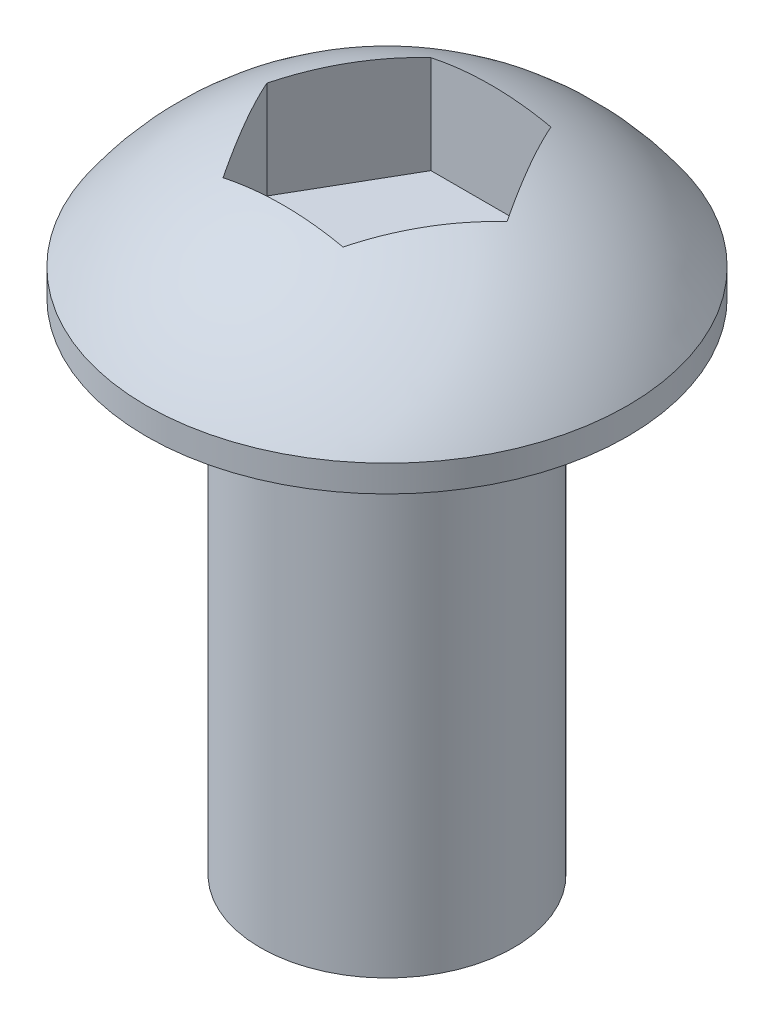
ISO-10303-21;
HEADER;
FILE_DESCRIPTION(('STEP AP214'),'2;1');
FILE_NAME('part.step','',(''),(''),'','','');
FILE_SCHEMA(('AUTOMOTIVE_DESIGN { 1 0 10303 214 1 1 1 1 }'));
ENDSEC;
DATA;
#1=APPLICATION_CONTEXT('core data for automotive mechanical design processes');
#2=APPLICATION_PROTOCOL_DEFINITION('international standard','automotive_design',2000,#1);
#3=PRODUCT_CONTEXT('',#1,'mechanical');
#4=PRODUCT('Part','Part','',(#3));
#5=PRODUCT_RELATED_PRODUCT_CATEGORY('part','',(#4));
#6=PRODUCT_DEFINITION_FORMATION('','',#4);
#7=PRODUCT_DEFINITION_CONTEXT('part definition',#1,'design');
#8=PRODUCT_DEFINITION('design','',#6,#7);
#9=PRODUCT_DEFINITION_SHAPE('','',#8);
#10=(LENGTH_UNIT() NAMED_UNIT(*) SI_UNIT(.MILLI.,.METRE.));
#11=(NAMED_UNIT(*) PLANE_ANGLE_UNIT() SI_UNIT($,.RADIAN.));
#12=(NAMED_UNIT(*) SI_UNIT($,.STERADIAN.) SOLID_ANGLE_UNIT());
#13=UNCERTAINTY_MEASURE_WITH_UNIT(LENGTH_MEASURE(1.E-05),#10,'distance_accuracy_value','');
#14=(GEOMETRIC_REPRESENTATION_CONTEXT(3) GLOBAL_UNCERTAINTY_ASSIGNED_CONTEXT((#13)) GLOBAL_UNIT_ASSIGNED_CONTEXT((#10,
#11,#12)) REPRESENTATION_CONTEXT('',''));
#15=CARTESIAN_POINT('',(0.,0.,0.));
#16=DIRECTION('',(0.,0.,1.));
#17=DIRECTION('',(1.,0.,0.));
#18=AXIS2_PLACEMENT_3D('',#15,#16,#17);
#19=CARTESIAN_POINT('',(0.,0.,0.));
#20=DIRECTION('',(0.,1.,0.));
#21=DIRECTION('',(0.,0.,1.));
#22=AXIS2_PLACEMENT_3D('',#19,#20,#21);
#23=PLANE('',#22);
#24=CARTESIAN_POINT('',(0.,0.,0.));
#25=DIRECTION('',(0.,1.,0.));
#26=DIRECTION('',(0.,0.,1.));
#27=AXIS2_PLACEMENT_3D('',#24,#25,#26);
#28=CIRCLE('',#27,4.5847);
#29=CARTESIAN_POINT('',(0.,0.,4.5847));
#30=VERTEX_POINT('',#29);
#31=EDGE_CURVE('E120',#30,#30,#28,.T.);
#32=ORIENTED_EDGE('',*,*,#31,.F.);
#33=EDGE_LOOP('',(#32));
#34=FACE_BOUND('',#33,.T.);
#35=CARTESIAN_POINT('',(0.,0.,0.));
#36=DIRECTION('',(0.,1.,0.));
#37=DIRECTION('',(0.,0.,1.));
#38=AXIS2_PLACEMENT_3D('',#35,#36,#37);
#39=CIRCLE('',#38,2.413);
#40=CARTESIAN_POINT('',(0.,0.,2.413));
#41=VERTEX_POINT('',#40);
#42=EDGE_CURVE('E11',#41,#41,#39,.F.);
#43=ORIENTED_EDGE('',*,*,#42,.F.);
#44=EDGE_LOOP('',(#43));
#45=FACE_BOUND('',#44,.T.);
#46=ADVANCED_FACE('F32',(#34,#45),#23,.F.);
#47=CARTESIAN_POINT('',(0.,-0.666297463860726,0.));
#48=DIRECTION('',(0.,1.,0.));
#49=DIRECTION('',(0.,0.,1.));
#50=AXIS2_PLACEMENT_3D('',#47,#48,#49);
#51=CYLINDRICAL_SURFACE('',#50,4.5847);
#52=CARTESIAN_POINT('',(0.,0.508,0.));
#53=DIRECTION('',(0.,1.,0.));
#54=DIRECTION('',(0.,0.,1.));
#55=AXIS2_PLACEMENT_3D('',#52,#53,#54);
#56=CIRCLE('',#55,4.5847);
#57=CARTESIAN_POINT('',(0.,0.508,4.5847));
#58=VERTEX_POINT('',#57);
#59=EDGE_CURVE('E132',#58,#58,#56,.T.);
#60=ORIENTED_EDGE('',*,*,#59,.F.);
#61=EDGE_LOOP('',(#60));
#62=FACE_BOUND('',#61,.T.);
#63=ORIENTED_EDGE('',*,*,#31,.T.);
#64=EDGE_LOOP('',(#63));
#65=FACE_BOUND('',#64,.T.);
#66=ADVANCED_FACE('F34',(#62,#65),#51,.T.);
#67=CARTESIAN_POINT('',(0.,-2.5654,0.));
#68=DIRECTION('',(0.,1.,0.));
#69=DIRECTION('',(0.,0.,1.));
#70=AXIS2_PLACEMENT_3D('',#67,#68,#69);
#71=DEGENERATE_TOROIDAL_SURFACE('',#70,0.132231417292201,5.4102,.T.);
#72=CARTESIAN_POINT('',(-2.28780817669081,2.39683264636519,0.000200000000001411));
#73=CARTESIAN_POINT('',(-2.13847220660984,2.4617053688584,-0.258457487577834));
#74=CARTESIAN_POINT('',(-1.98619944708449,2.50073459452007,-0.522201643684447));
#75=CARTESIAN_POINT('',(-1.68322433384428,2.52696116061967,-1.04696993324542));
#76=CARTESIAN_POINT('',(-1.53254139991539,2.51505719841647,-1.30796043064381));
#77=CARTESIAN_POINT('',(-1.34340882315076,2.46838066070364,-1.63554766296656));
#78=CARTESIAN_POINT('',(-1.30336611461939,2.45666009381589,-1.70490366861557));
#79=CARTESIAN_POINT('',(-1.22339667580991,2.42952765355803,-1.84341479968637));
#80=CARTESIAN_POINT('',(-1.18347142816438,2.41409830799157,-1.91256735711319));
#81=CARTESIAN_POINT('',(-1.14373088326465,2.39683264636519,-1.9814));
#82=B_SPLINE_CURVE_WITH_KNOTS('',3,(#72,#73,#74,#75,#76,#77,#78,#79,#80,#81),.UNSPECIFIED.,.F.,
.F.,(4,2,2,2,4),(0.,0.916394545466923,1.81668695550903,2.05944608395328,2.30337208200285),.UNSPECIFIED.);
#83=CARTESIAN_POINT('',(-2.28769270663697,2.39688280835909,0.));
#84=VERTEX_POINT('',#83);
#85=CARTESIAN_POINT('',(-1.14384635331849,2.39688280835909,-1.9812));
#86=VERTEX_POINT('',#85);
#87=EDGE_CURVE('E135',#84,#86,#82,.T.);
#88=ORIENTED_EDGE('',*,*,#87,.T.);
#89=CARTESIAN_POINT('',(0.,2.51904482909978,-1.9812));
#90=CARTESIAN_POINT('',(0.30337166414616,2.51902920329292,-1.9812));
#91=CARTESIAN_POINT('',(0.607140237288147,2.49366734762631,-1.9812));
#92=CARTESIAN_POINT('',(1.05602433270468,2.41739443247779,-1.9812));
#93=CARTESIAN_POINT('',(1.20467373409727,2.38554590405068,-1.9812));
#94=CARTESIAN_POINT('',(1.49870374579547,2.30909958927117,-1.9812));
#95=CARTESIAN_POINT('',(1.64408465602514,2.26450297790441,-1.9812));
#96=CARTESIAN_POINT('',(1.9305540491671,2.16268283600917,-1.9812));
#97=CARTESIAN_POINT('',(2.07163681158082,2.10544324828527,-1.9812));
#98=CARTESIAN_POINT('',(2.34824418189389,1.97868217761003,-1.9812));
#99=CARTESIAN_POINT('',(2.4837666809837,1.90915608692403,-1.9812));
#100=CARTESIAN_POINT('',(2.74799197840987,1.75836760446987,-1.9812));
#101=CARTESIAN_POINT('',(2.87669947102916,1.67711343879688,-1.9812));
#102=CARTESIAN_POINT('',(3.126390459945,1.50339924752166,-1.9812));
#103=CARTESIAN_POINT('',(3.2473711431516,1.41093517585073,-1.9812));
#104=CARTESIAN_POINT('',(3.47452103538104,1.22060053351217,-1.9812));
#105=CARTESIAN_POINT('',(3.58113274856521,1.12325740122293,-1.9812));
#106=CARTESIAN_POINT('',(3.78572022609,0.919810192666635,-1.9812));
#107=CARTESIAN_POINT('',(3.88369291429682,0.813703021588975,-1.9812));
#108=CARTESIAN_POINT('',(4.0701891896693,0.593570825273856,-1.9812));
#109=CARTESIAN_POINT('',(4.15871709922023,0.479549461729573,-1.9812));
#110=CARTESIAN_POINT('',(4.32575213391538,0.244324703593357,-1.9812));
#111=CARTESIAN_POINT('',(4.40425556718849,0.123118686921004,-1.9812));
#112=CARTESIAN_POINT('',(4.54975169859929,-0.124077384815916,-1.9812));
#113=CARTESIAN_POINT('',(4.61687008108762,-0.249993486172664,-1.9812));
#114=CARTESIAN_POINT('',(4.74025596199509,-0.507091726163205,-1.9812));
#115=CARTESIAN_POINT('',(4.79651947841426,-0.638275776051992,-1.9812));
#116=CARTESIAN_POINT('',(4.89773783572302,-0.904878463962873,-1.9812));
#117=CARTESIAN_POINT('',(4.94269707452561,-1.04029543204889,-1.9812));
#118=CARTESIAN_POINT('',(5.02102572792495,-1.31449245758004,-1.9812));
#119=CARTESIAN_POINT('',(5.05439086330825,-1.45327373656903,-1.9812));
#120=CARTESIAN_POINT('',(5.10917372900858,-1.73270693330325,-1.9812));
#121=CARTESIAN_POINT('',(5.13063067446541,-1.87335113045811,-1.9812));
#122=CARTESIAN_POINT('',(5.16162676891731,-2.15596079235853,-1.9812));
#123=CARTESIAN_POINT('',(5.17116152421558,-2.29792672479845,-1.9812));
#124=CARTESIAN_POINT('',(5.18170919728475,-2.72418452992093,-1.9812));
#125=CARTESIAN_POINT('',(5.16472492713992,-3.00914085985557,-1.9812));
#126=CARTESIAN_POINT('',(5.08315630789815,-3.57178704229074,-1.9812));
#127=CARTESIAN_POINT('',(5.01860669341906,-3.84948204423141,-1.9812));
#128=CARTESIAN_POINT('',(4.84382209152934,-4.39013830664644,-1.9812));
#129=CARTESIAN_POINT('',(4.7335876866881,-4.65309975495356,-1.9812));
#130=CARTESIAN_POINT('',(4.47052968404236,-5.15690770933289,-1.9812));
#131=CARTESIAN_POINT('',(4.31768805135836,-5.39774479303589,-1.9812));
#132=CARTESIAN_POINT('',(3.97381387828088,-5.85041884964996,-1.9812));
#133=CARTESIAN_POINT('',(3.78277968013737,-6.0622545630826,-1.9812));
#134=CARTESIAN_POINT('',(3.36753976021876,-6.45145179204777,-1.9812));
#135=CARTESIAN_POINT('',(3.14326080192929,-6.62873514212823,-1.9812));
#136=CARTESIAN_POINT('',(2.66834278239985,-6.94340129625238,-1.9812));
#137=CARTESIAN_POINT('',(2.41770853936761,-7.08079137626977,-1.9812));
#138=CARTESIAN_POINT('',(1.89531762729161,-7.31316981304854,-1.9812));
#139=CARTESIAN_POINT('',(1.62341715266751,-7.40783374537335,-1.9812));
#140=CARTESIAN_POINT('',(1.06761828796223,-7.55161233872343,-1.9812));
#141=CARTESIAN_POINT('',(0.783713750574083,-7.60070335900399,-1.9812));
#142=CARTESIAN_POINT('',(0.350613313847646,-7.64057717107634,-1.9812));
#143=CARTESIAN_POINT('',(0.202750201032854,-7.6480832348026,-1.9812));
#144=CARTESIAN_POINT('',(-0.0931380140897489,-7.65105506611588,-1.9812));
#145=CARTESIAN_POINT('',(-0.241163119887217,-7.64652056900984,-1.9812));
#146=CARTESIAN_POINT('',(-0.536332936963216,-7.6253731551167,-1.9812));
#147=CARTESIAN_POINT('',(-0.683477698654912,-7.60876093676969,-1.9812));
#148=CARTESIAN_POINT('',(-0.975889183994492,-7.56341224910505,-1.9812));
#149=CARTESIAN_POINT('',(-1.12115596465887,-7.53467614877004,-1.9812));
#150=CARTESIAN_POINT('',(-1.4126389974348,-7.46415705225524,-1.9812));
#151=CARTESIAN_POINT('',(-1.55877556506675,-7.42204370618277,-1.9812));
#152=CARTESIAN_POINT('',(-1.84681555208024,-7.32519993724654,-1.9812));
#153=CARTESIAN_POINT('',(-1.98871883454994,-7.27046910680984,-1.9812));
#154=CARTESIAN_POINT('',(-2.26709683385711,-7.14871949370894,-1.9812));
#155=CARTESIAN_POINT('',(-2.40357341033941,-7.08170496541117,-1.9812));
#156=CARTESIAN_POINT('',(-2.67008705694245,-6.93579752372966,-1.9812));
#157=CARTESIAN_POINT('',(-2.80012192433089,-6.85690058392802,-1.9812));
#158=CARTESIAN_POINT('',(-3.04723563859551,-6.69143993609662,-1.9812));
#159=CARTESIAN_POINT('',(-3.16463068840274,-6.60534801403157,-1.9812));
#160=CARTESIAN_POINT('',(-3.39166025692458,-6.42339257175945,-1.9812));
#161=CARTESIAN_POINT('',(-3.50129195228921,-6.32752552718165,-1.9812));
#162=CARTESIAN_POINT('',(-3.71187820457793,-6.12677481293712,-1.9812));
#163=CARTESIAN_POINT('',(-3.8128362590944,-6.02189481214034,-1.9812));
#164=CARTESIAN_POINT('',(-4.0054020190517,-5.80380568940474,-1.9812));
#165=CARTESIAN_POINT('',(-4.09700628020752,-5.69059352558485,-1.9812));
#166=CARTESIAN_POINT('',(-4.26855746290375,-5.4588330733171,-1.9812));
#167=CARTESIAN_POINT('',(-4.3486859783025,-5.34041914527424,-1.9812));
#168=CARTESIAN_POINT('',(-4.49867018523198,-5.09719435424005,-1.9812));
#169=CARTESIAN_POINT('',(-4.56852212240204,-4.97238117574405,-1.9812));
#170=CARTESIAN_POINT('',(-4.69738192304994,-4.71734568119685,-1.9812));
#171=CARTESIAN_POINT('',(-4.75639454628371,-4.58712577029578,-1.9812));
#172=CARTESIAN_POINT('',(-4.86320555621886,-4.32211153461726,-1.9812));
#173=CARTESIAN_POINT('',(-4.91099980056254,-4.18731554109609,-1.9812));
#174=CARTESIAN_POINT('',(-4.99479999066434,-3.91479550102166,-1.9812));
#175=CARTESIAN_POINT('',(-5.03086053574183,-3.77708828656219,-1.9812));
#176=CARTESIAN_POINT('',(-5.0912549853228,-3.49910771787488,-1.9812));
#177=CARTESIAN_POINT('',(-5.11558450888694,-3.35883342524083,-1.9812));
#178=CARTESIAN_POINT('',(-5.17064071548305,-2.93578077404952,-1.9812));
#179=CARTESIAN_POINT('',(-5.18352536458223,-2.65047786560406,-1.9812));
#180=CARTESIAN_POINT('',(-5.16109302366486,-2.08212114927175,-1.9812));
#181=CARTESIAN_POINT('',(-5.12583433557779,-1.79906503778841,-1.9812));
#182=CARTESIAN_POINT('',(-5.03780300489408,-1.38215529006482,-1.9812));
#183=CARTESIAN_POINT('',(-5.00257387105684,-1.24439312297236,-1.9812));
#184=CARTESIAN_POINT('',(-4.92064810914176,-0.97234085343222,-1.9812));
#185=CARTESIAN_POINT('',(-4.87395576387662,-0.838049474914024,-1.9812));
#186=CARTESIAN_POINT('',(-4.76940913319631,-0.573821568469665,-1.9812));
#187=CARTESIAN_POINT('',(-4.7115496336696,-0.443887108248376,-1.9812));
#188=CARTESIAN_POINT('',(-4.58512108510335,-0.189394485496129,-1.9812));
#189=CARTESIAN_POINT('',(-4.51655597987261,-0.0648343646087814,-1.9812));
#190=CARTESIAN_POINT('',(-4.36916779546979,0.178118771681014,-1.9812));
#191=CARTESIAN_POINT('',(-4.29034121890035,0.296509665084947,-1.9812));
#192=CARTESIAN_POINT('',(-4.12304505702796,0.526203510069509,-1.9812));
#193=CARTESIAN_POINT('',(-4.03457900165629,0.637509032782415,-1.9812));
#194=CARTESIAN_POINT('',(-3.84845252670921,0.852487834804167,-1.9812));
#195=CARTESIAN_POINT('',(-3.75077631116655,0.956147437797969,-1.9812));
#196=CARTESIAN_POINT('',(-3.5471009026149,1.15486110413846,-1.9812));
#197=CARTESIAN_POINT('',(-3.44110473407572,1.2499182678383,-1.9812));
#198=CARTESIAN_POINT('',(-3.22146212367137,1.43086485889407,-1.9812));
#199=CARTESIAN_POINT('',(-3.10781162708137,1.51674936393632,-1.9812));
#200=CARTESIAN_POINT('',(-2.87377042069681,1.67868594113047,-1.9812));
#201=CARTESIAN_POINT('',(-2.75338211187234,1.75474148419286,-1.9812));
#202=CARTESIAN_POINT('',(-2.50596755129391,1.89698007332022,-1.9812));
#203=CARTESIAN_POINT('',(-2.378906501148,1.96310258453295,-1.9812));
#204=CARTESIAN_POINT('',(-2.11976497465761,2.08451263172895,-1.9812));
#205=CARTESIAN_POINT('',(-1.98768620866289,2.13980382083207,-1.9812));
#206=CARTESIAN_POINT('',(-1.71952291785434,2.23924247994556,-1.9812));
#207=CARTESIAN_POINT('',(-1.58344179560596,2.28339912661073,-1.9812));
#208=CARTESIAN_POINT('',(-1.30817514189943,2.36044140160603,-1.9812));
#209=CARTESIAN_POINT('',(-1.16899035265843,2.39332969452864,-1.9812));
#210=CARTESIAN_POINT('',(-0.859375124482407,2.45342095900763,-1.9812));
#211=CARTESIAN_POINT('',(-0.68843537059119,2.47804178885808,-1.9812));
#212=CARTESIAN_POINT('',(-0.345040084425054,2.51085973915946,-1.9812));
#213=CARTESIAN_POINT('',(-0.172584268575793,2.51905371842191,-1.9812));
#214=CARTESIAN_POINT('',(0.,2.51904482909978,-1.9812));
#215=B_SPLINE_CURVE_WITH_KNOTS('',3,(#89,#90,#91,#92,#93,#94,#95,#96,#97,#98,#99,#100,#101,#102,
#103,#104,#105,#106,#107,#108,#109,#110,#111,#112,#113,#114,#115,#116,#117,#118,#119,#120,#121,
#122,#123,#124,#125,#126,#127,#128,#129,#130,#131,#132,#133,#134,#135,#136,#137,#138,#139,#140,
#141,#142,#143,#144,#145,#146,#147,#148,#149,#150,#151,#152,#153,#154,#155,#156,#157,#158,#159,
#160,#161,#162,#163,#164,#165,#166,#167,#168,#169,#170,#171,#172,#173,#174,#175,#176,#177,#178,
#179,#180,#181,#182,#183,#184,#185,#186,#187,#188,#189,#190,#191,#192,#193,#194,#195,#196,#197,
#198,#199,#200,#201,#202,#203,#204,#205,#206,#207,#208,#209,#210,#211,#212,#213,#214),
.UNSPECIFIED.,.T.,.F.,(4,2,2,2,2,2,2,2,2,2,2,2,2,2,2,2,2,2,2,2,2,2,2,2,2,2,2,2,2,2,2,2,2,2,2,2,
2,2,2,2,2,2,2,2,2,2,2,2,2,2,2,2,2,2,2,2,2,2,2,2,2,2,4),(0.,0.909387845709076,1.36502064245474,
1.82061145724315,2.27678425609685,2.73312849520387,3.18915419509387,3.64534498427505,
4.0779270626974,4.51066255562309,4.94319915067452,5.37589458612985,5.80344886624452,
6.23115969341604,6.65870386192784,7.08640566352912,7.51269050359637,7.93913239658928,
8.79109735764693,9.6424407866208,10.4937733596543,11.3454668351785,12.1971972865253,
13.0508327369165,13.9043123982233,14.7641678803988,15.6244691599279,16.068228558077,
16.5119977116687,16.9557412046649,17.3994711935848,17.8551445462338,18.3108326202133,
18.7663631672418,19.2220484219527,19.6582581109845,20.0946256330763,20.5308163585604,
20.9671671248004,21.3955881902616,21.8241653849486,22.2525539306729,22.681100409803,
23.1076232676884,23.534305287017,24.3867562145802,25.238175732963,25.6643396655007,
26.0903446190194,26.516548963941,26.942596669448,27.3687899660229,27.7948277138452,
28.2216099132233,28.6482376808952,29.0750932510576,29.5017976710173,29.931005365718,
30.3600680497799,30.7887759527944,31.2173824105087,31.7346226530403,32.2519617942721),.UNSPECIFIED.);
#216=CARTESIAN_POINT('',(1.14384635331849,2.39688280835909,-1.9812));
#217=VERTEX_POINT('',#216);
#218=EDGE_CURVE('E40',#86,#217,#215,.T.);
#219=ORIENTED_EDGE('',*,*,#218,.T.);
#220=CARTESIAN_POINT('',(1.14373088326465,2.39683264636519,-1.9814));
#221=CARTESIAN_POINT('',(1.29306685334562,2.4617053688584,-1.72274251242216));
#222=CARTESIAN_POINT('',(1.44533961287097,2.50073459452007,-1.45899835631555));
#223=CARTESIAN_POINT('',(1.74831472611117,2.52696116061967,-0.934230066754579));
#224=CARTESIAN_POINT('',(1.89899766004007,2.51505719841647,-0.673239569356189));
#225=CARTESIAN_POINT('',(2.0881302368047,2.46838066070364,-0.345652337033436));
#226=CARTESIAN_POINT('',(2.12817294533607,2.4566600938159,-0.276296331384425));
#227=CARTESIAN_POINT('',(2.20814238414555,2.42952765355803,-0.137785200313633));
#228=CARTESIAN_POINT('',(2.24806763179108,2.41409830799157,-0.0686326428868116));
#229=CARTESIAN_POINT('',(2.28780817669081,2.39683264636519,0.000199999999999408));
#230=B_SPLINE_CURVE_WITH_KNOTS('',3,(#220,#221,#222,#223,#224,#225,#226,#227,#228,#229),
.UNSPECIFIED.,.F.,.F.,(4,2,2,2,4),(0.,0.916394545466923,1.81668695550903,2.05944608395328,
2.30337208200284),.UNSPECIFIED.);
#231=CARTESIAN_POINT('',(2.28769270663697,2.39688280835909,0.));
#232=VERTEX_POINT('',#231);
#233=EDGE_CURVE('E55',#217,#232,#230,.T.);
#234=ORIENTED_EDGE('',*,*,#233,.T.);
#235=CARTESIAN_POINT('',(2.28780817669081,2.39683264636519,-0.00020000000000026));
#236=CARTESIAN_POINT('',(2.13847220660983,2.4617053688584,0.258457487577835));
#237=CARTESIAN_POINT('',(1.98619944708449,2.50073459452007,0.522201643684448));
#238=CARTESIAN_POINT('',(1.68322433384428,2.52696116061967,1.04696993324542));
#239=CARTESIAN_POINT('',(1.53254139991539,2.51505719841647,1.30796043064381));
#240=CARTESIAN_POINT('',(1.34340882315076,2.46838066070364,1.63554766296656));
#241=CARTESIAN_POINT('',(1.30336611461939,2.45666009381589,1.70490366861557));
#242=CARTESIAN_POINT('',(1.22339667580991,2.42952765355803,1.84341479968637));
#243=CARTESIAN_POINT('',(1.18347142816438,2.41409830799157,1.91256735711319));
#244=CARTESIAN_POINT('',(1.14373088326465,2.39683264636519,1.9814));
#245=B_SPLINE_CURVE_WITH_KNOTS('',3,(#235,#236,#237,#238,#239,#240,#241,#242,#243,#244),
.UNSPECIFIED.,.F.,.F.,(4,2,2,2,4),(0.,0.916394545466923,1.81668695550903,2.05944608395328,
2.30337208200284),.UNSPECIFIED.);
#246=CARTESIAN_POINT('',(1.14384635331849,2.39688280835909,1.9812));
#247=VERTEX_POINT('',#246);
#248=EDGE_CURVE('E167',#232,#247,#245,.T.);
#249=ORIENTED_EDGE('',*,*,#248,.T.);
#250=CARTESIAN_POINT('',(0.,2.51904482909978,1.9812));
#251=CARTESIAN_POINT('',(-0.30337166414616,2.51902920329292,1.9812));
#252=CARTESIAN_POINT('',(-0.607140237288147,2.49366734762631,1.9812));
#253=CARTESIAN_POINT('',(-1.05602433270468,2.41739443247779,1.9812));
#254=CARTESIAN_POINT('',(-1.20467373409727,2.38554590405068,1.9812));
#255=CARTESIAN_POINT('',(-1.49870374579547,2.30909958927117,1.9812));
#256=CARTESIAN_POINT('',(-1.64408465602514,2.26450297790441,1.9812));
#257=CARTESIAN_POINT('',(-1.9305540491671,2.16268283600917,1.9812));
#258=CARTESIAN_POINT('',(-2.07163681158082,2.10544324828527,1.9812));
#259=CARTESIAN_POINT('',(-2.34824418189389,1.97868217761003,1.9812));
#260=CARTESIAN_POINT('',(-2.4837666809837,1.90915608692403,1.9812));
#261=CARTESIAN_POINT('',(-2.74799197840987,1.75836760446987,1.9812));
#262=CARTESIAN_POINT('',(-2.87669947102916,1.67711343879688,1.9812));
#263=CARTESIAN_POINT('',(-3.126390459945,1.50339924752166,1.9812));
#264=CARTESIAN_POINT('',(-3.2473711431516,1.41093517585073,1.9812));
#265=CARTESIAN_POINT('',(-3.47452103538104,1.22060053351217,1.9812));
#266=CARTESIAN_POINT('',(-3.58113274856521,1.12325740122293,1.9812));
#267=CARTESIAN_POINT('',(-3.78572022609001,0.919810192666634,1.9812));
#268=CARTESIAN_POINT('',(-3.88369291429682,0.813703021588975,1.9812));
#269=CARTESIAN_POINT('',(-4.0701891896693,0.593570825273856,1.9812));
#270=CARTESIAN_POINT('',(-4.15871709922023,0.479549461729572,1.9812));
#271=CARTESIAN_POINT('',(-4.32575213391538,0.244324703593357,1.9812));
#272=CARTESIAN_POINT('',(-4.40425556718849,0.123118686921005,1.9812));
#273=CARTESIAN_POINT('',(-4.54975169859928,-0.124077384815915,1.9812));
#274=CARTESIAN_POINT('',(-4.61687008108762,-0.249993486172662,1.9812));
#275=CARTESIAN_POINT('',(-4.74025596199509,-0.507091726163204,1.9812));
#276=CARTESIAN_POINT('',(-4.79651947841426,-0.638275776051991,1.9812));
#277=CARTESIAN_POINT('',(-4.89773783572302,-0.904878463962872,1.9812));
#278=CARTESIAN_POINT('',(-4.94269707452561,-1.04029543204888,1.9812));
#279=CARTESIAN_POINT('',(-5.02102572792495,-1.31449245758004,1.9812));
#280=CARTESIAN_POINT('',(-5.05439086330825,-1.45327373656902,1.9812));
#281=CARTESIAN_POINT('',(-5.10917372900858,-1.73270693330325,1.9812));
#282=CARTESIAN_POINT('',(-5.13063067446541,-1.87335113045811,1.9812));
#283=CARTESIAN_POINT('',(-5.16162676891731,-2.15596079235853,1.9812));
#284=CARTESIAN_POINT('',(-5.17116152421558,-2.29792672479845,1.9812));
#285=CARTESIAN_POINT('',(-5.18170919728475,-2.72418452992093,1.9812));
#286=CARTESIAN_POINT('',(-5.16472492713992,-3.00914085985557,1.9812));
#287=CARTESIAN_POINT('',(-5.08315630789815,-3.57178704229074,1.9812));
#288=CARTESIAN_POINT('',(-5.01860669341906,-3.84948204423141,1.9812));
#289=CARTESIAN_POINT('',(-4.84382209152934,-4.39013830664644,1.9812));
#290=CARTESIAN_POINT('',(-4.7335876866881,-4.65309975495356,1.9812));
#291=CARTESIAN_POINT('',(-4.47052968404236,-5.15690770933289,1.9812));
#292=CARTESIAN_POINT('',(-4.31768805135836,-5.39774479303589,1.9812));
#293=CARTESIAN_POINT('',(-3.97381387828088,-5.85041884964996,1.9812));
#294=CARTESIAN_POINT('',(-3.78277968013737,-6.0622545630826,1.9812));
#295=CARTESIAN_POINT('',(-3.36753976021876,-6.45145179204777,1.9812));
#296=CARTESIAN_POINT('',(-3.14326080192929,-6.62873514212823,1.9812));
#297=CARTESIAN_POINT('',(-2.66834278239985,-6.94340129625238,1.9812));
#298=CARTESIAN_POINT('',(-2.41770853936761,-7.08079137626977,1.9812));
#299=CARTESIAN_POINT('',(-1.89531762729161,-7.31316981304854,1.9812));
#300=CARTESIAN_POINT('',(-1.62341715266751,-7.40783374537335,1.9812));
#301=CARTESIAN_POINT('',(-1.06761828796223,-7.55161233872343,1.9812));
#302=CARTESIAN_POINT('',(-0.783713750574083,-7.60070335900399,1.9812));
#303=CARTESIAN_POINT('',(-0.350613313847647,-7.64057717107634,1.9812));
#304=CARTESIAN_POINT('',(-0.202750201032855,-7.6480832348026,1.9812));
#305=CARTESIAN_POINT('',(0.0931380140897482,-7.65105506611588,1.9812));
#306=CARTESIAN_POINT('',(0.241163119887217,-7.64652056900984,1.9812));
#307=CARTESIAN_POINT('',(0.536332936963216,-7.6253731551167,1.9812));
#308=CARTESIAN_POINT('',(0.683477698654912,-7.60876093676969,1.9812));
#309=CARTESIAN_POINT('',(0.975889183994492,-7.56341224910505,1.9812));
#310=CARTESIAN_POINT('',(1.12115596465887,-7.53467614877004,1.9812));
#311=CARTESIAN_POINT('',(1.4126389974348,-7.46415705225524,1.9812));
#312=CARTESIAN_POINT('',(1.55877556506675,-7.42204370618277,1.9812));
#313=CARTESIAN_POINT('',(1.84681555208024,-7.32519993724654,1.9812));
#314=CARTESIAN_POINT('',(1.98871883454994,-7.27046910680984,1.9812));
#315=CARTESIAN_POINT('',(2.26709683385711,-7.14871949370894,1.9812));
#316=CARTESIAN_POINT('',(2.4035734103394,-7.08170496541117,1.9812));
#317=CARTESIAN_POINT('',(2.67008705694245,-6.93579752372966,1.9812));
#318=CARTESIAN_POINT('',(2.80012192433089,-6.85690058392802,1.9812));
#319=CARTESIAN_POINT('',(3.04723563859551,-6.69143993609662,1.9812));
#320=CARTESIAN_POINT('',(3.16463068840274,-6.60534801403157,1.9812));
#321=CARTESIAN_POINT('',(3.39166025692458,-6.42339257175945,1.9812));
#322=CARTESIAN_POINT('',(3.50129195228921,-6.32752552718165,1.9812));
#323=CARTESIAN_POINT('',(3.71187820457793,-6.12677481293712,1.9812));
#324=CARTESIAN_POINT('',(3.8128362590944,-6.02189481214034,1.9812));
#325=CARTESIAN_POINT('',(4.0054020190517,-5.80380568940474,1.9812));
#326=CARTESIAN_POINT('',(4.09700628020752,-5.69059352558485,1.9812));
#327=CARTESIAN_POINT('',(4.26855746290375,-5.4588330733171,1.9812));
#328=CARTESIAN_POINT('',(4.3486859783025,-5.34041914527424,1.9812));
#329=CARTESIAN_POINT('',(4.49867018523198,-5.09719435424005,1.9812));
#330=CARTESIAN_POINT('',(4.56852212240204,-4.97238117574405,1.9812));
#331=CARTESIAN_POINT('',(4.69738192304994,-4.71734568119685,1.9812));
#332=CARTESIAN_POINT('',(4.75639454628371,-4.58712577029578,1.9812));
#333=CARTESIAN_POINT('',(4.86320555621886,-4.32211153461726,1.9812));
#334=CARTESIAN_POINT('',(4.91099980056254,-4.18731554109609,1.9812));
#335=CARTESIAN_POINT('',(4.99479999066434,-3.91479550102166,1.9812));
#336=CARTESIAN_POINT('',(5.03086053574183,-3.77708828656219,1.9812));
#337=CARTESIAN_POINT('',(5.0912549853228,-3.49910771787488,1.9812));
#338=CARTESIAN_POINT('',(5.11558450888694,-3.35883342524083,1.9812));
#339=CARTESIAN_POINT('',(5.17064071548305,-2.93578077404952,1.9812));
#340=CARTESIAN_POINT('',(5.18352536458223,-2.65047786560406,1.9812));
#341=CARTESIAN_POINT('',(5.16109302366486,-2.08212114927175,1.9812));
#342=CARTESIAN_POINT('',(5.12583433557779,-1.79906503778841,1.9812));
#343=CARTESIAN_POINT('',(5.03780300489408,-1.38215529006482,1.9812));
#344=CARTESIAN_POINT('',(5.00257387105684,-1.24439312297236,1.9812));
#345=CARTESIAN_POINT('',(4.92064810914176,-0.972340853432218,1.9812));
#346=CARTESIAN_POINT('',(4.87395576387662,-0.838049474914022,1.9812));
#347=CARTESIAN_POINT('',(4.76940913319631,-0.573821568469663,1.9812));
#348=CARTESIAN_POINT('',(4.7115496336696,-0.443887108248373,1.9812));
#349=CARTESIAN_POINT('',(4.58512108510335,-0.189394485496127,1.9812));
#350=CARTESIAN_POINT('',(4.51655597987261,-0.0648343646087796,1.9812));
#351=CARTESIAN_POINT('',(4.36916779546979,0.178118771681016,1.9812));
#352=CARTESIAN_POINT('',(4.29034121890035,0.296509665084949,1.9812));
#353=CARTESIAN_POINT('',(4.12304505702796,0.526203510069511,1.9812));
#354=CARTESIAN_POINT('',(4.03457900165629,0.637509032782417,1.9812));
#355=CARTESIAN_POINT('',(3.8484525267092,0.852487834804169,1.9812));
#356=CARTESIAN_POINT('',(3.75077631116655,0.956147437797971,1.9812));
#357=CARTESIAN_POINT('',(3.54710090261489,1.15486110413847,1.9812));
#358=CARTESIAN_POINT('',(3.44110473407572,1.24991826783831,1.9812));
#359=CARTESIAN_POINT('',(3.22146212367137,1.43086485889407,1.9812));
#360=CARTESIAN_POINT('',(3.10781162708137,1.51674936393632,1.9812));
#361=CARTESIAN_POINT('',(2.87377042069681,1.67868594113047,1.9812));
#362=CARTESIAN_POINT('',(2.75338211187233,1.75474148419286,1.9812));
#363=CARTESIAN_POINT('',(2.5059675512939,1.89698007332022,1.9812));
#364=CARTESIAN_POINT('',(2.378906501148,1.96310258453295,1.9812));
#365=CARTESIAN_POINT('',(2.11976497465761,2.08451263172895,1.9812));
#366=CARTESIAN_POINT('',(1.98768620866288,2.13980382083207,1.9812));
#367=CARTESIAN_POINT('',(1.71952291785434,2.23924247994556,1.9812));
#368=CARTESIAN_POINT('',(1.58344179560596,2.28339912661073,1.9812));
#369=CARTESIAN_POINT('',(1.30817514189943,2.36044140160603,1.9812));
#370=CARTESIAN_POINT('',(1.16899035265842,2.39332969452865,1.9812));
#371=CARTESIAN_POINT('',(0.859375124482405,2.45342095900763,1.9812));
#372=CARTESIAN_POINT('',(0.688435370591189,2.47804178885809,1.9812));
#373=CARTESIAN_POINT('',(0.345040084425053,2.51085973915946,1.9812));
#374=CARTESIAN_POINT('',(0.172584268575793,2.51905371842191,1.9812));
#375=CARTESIAN_POINT('',(0.,2.51904482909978,1.9812));
#376=B_SPLINE_CURVE_WITH_KNOTS('',3,(#250,#251,#252,#253,#254,#255,#256,#257,#258,#259,#260,
#261,#262,#263,#264,#265,#266,#267,#268,#269,#270,#271,#272,#273,#274,#275,#276,#277,#278,#279,
#280,#281,#282,#283,#284,#285,#286,#287,#288,#289,#290,#291,#292,#293,#294,#295,#296,#297,#298,
#299,#300,#301,#302,#303,#304,#305,#306,#307,#308,#309,#310,#311,#312,#313,#314,#315,#316,#317,
#318,#319,#320,#321,#322,#323,#324,#325,#326,#327,#328,#329,#330,#331,#332,#333,#334,#335,#336,
#337,#338,#339,#340,#341,#342,#343,#344,#345,#346,#347,#348,#349,#350,#351,#352,#353,#354,#355,
#356,#357,#358,#359,#360,#361,#362,#363,#364,#365,#366,#367,#368,#369,#370,#371,#372,#373,#374,
#375),.UNSPECIFIED.,.T.,.F.,(4,2,2,2,2,2,2,2,2,2,2,2,2,2,2,2,2,2,2,2,2,2,2,2,2,2,2,2,2,2,2,2,2,
2,2,2,2,2,2,2,2,2,2,2,2,2,2,2,2,2,2,2,2,2,2,2,2,2,2,2,2,2,4),(0.,0.909387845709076,
1.36502064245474,1.82061145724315,2.27678425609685,2.73312849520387,3.18915419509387,
3.64534498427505,4.0779270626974,4.51066255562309,4.94319915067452,5.37589458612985,
5.80344886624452,6.23115969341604,6.65870386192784,7.08640566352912,7.51269050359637,
7.93913239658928,8.79109735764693,9.64244078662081,10.4937733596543,11.3454668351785,
12.1971972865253,13.0508327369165,13.9043123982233,14.7641678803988,15.6244691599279,
16.068228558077,16.5119977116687,16.9557412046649,17.3994711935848,17.8551445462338,
18.3108326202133,18.7663631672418,19.2220484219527,19.6582581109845,20.0946256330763,
20.5308163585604,20.9671671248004,21.3955881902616,21.8241653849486,22.2525539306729,
22.681100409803,23.1076232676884,23.534305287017,24.3867562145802,25.238175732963,
25.6643396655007,26.0903446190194,26.516548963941,26.942596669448,27.3687899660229,
27.7948277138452,28.2216099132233,28.6482376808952,29.0750932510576,29.5017976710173,
29.931005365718,30.3600680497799,30.7887759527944,31.2173824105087,31.7346226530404,
32.2519617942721),.UNSPECIFIED.);
#377=CARTESIAN_POINT('',(-1.14384635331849,2.39688280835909,1.9812));
#378=VERTEX_POINT('',#377);
#379=EDGE_CURVE('E184',#247,#378,#376,.T.);
#380=ORIENTED_EDGE('',*,*,#379,.T.);
#381=CARTESIAN_POINT('',(-1.14373088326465,2.39683264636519,1.9814));
#382=CARTESIAN_POINT('',(-1.29306685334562,2.4617053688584,1.72274251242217));
#383=CARTESIAN_POINT('',(-1.44533961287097,2.50073459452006,1.45899835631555));
#384=CARTESIAN_POINT('',(-1.74831472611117,2.52696116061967,0.93423006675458));
#385=CARTESIAN_POINT('',(-1.89899766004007,2.51505719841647,0.673239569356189));
#386=CARTESIAN_POINT('',(-2.0881302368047,2.46838066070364,0.345652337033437));
#387=CARTESIAN_POINT('',(-2.12817294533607,2.45666009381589,0.276296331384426));
#388=CARTESIAN_POINT('',(-2.20814238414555,2.42952765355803,0.137785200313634));
#389=CARTESIAN_POINT('',(-2.24806763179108,2.41409830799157,0.0686326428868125));
#390=CARTESIAN_POINT('',(-2.28780817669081,2.39683264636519,-0.000199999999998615));
#391=B_SPLINE_CURVE_WITH_KNOTS('',3,(#381,#382,#383,#384,#385,#386,#387,#388,#389,#390),
.UNSPECIFIED.,.F.,.F.,(4,2,2,2,4),(0.,0.916394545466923,1.81668695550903,2.05944608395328,
2.30337208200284),.UNSPECIFIED.);
#392=EDGE_CURVE('E141',#378,#84,#391,.T.);
#393=ORIENTED_EDGE('',*,*,#392,.T.);
#394=EDGE_LOOP('',(#88,#219,#234,#249,#380,#393));
#395=FACE_BOUND('',#394,.T.);
#396=ORIENTED_EDGE('',*,*,#59,.T.);
#397=EDGE_LOOP('',(#396));
#398=FACE_BOUND('',#397,.T.);
#399=ADVANCED_FACE('F147',(#395,#398),#71,.T.);
#400=CARTESIAN_POINT('',(1.14384635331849,0.533400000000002,-1.9812));
#401=DIRECTION('',(0.,0.,-1.));
#402=DIRECTION('',(-1.,0.,0.));
#403=AXIS2_PLACEMENT_3D('',#400,#401,#402);
#404=PLANE('',#403);
#405=DIRECTION('',(0.,1.,0.));
#406=VECTOR('',#405,1.);
#407=CARTESIAN_POINT('',(-1.14384635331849,0.533400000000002,-1.9812));
#408=LINE('',#407,#406);
#409=CARTESIAN_POINT('',(-1.14384635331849,0.533400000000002,-1.9812));
#410=VERTEX_POINT('',#409);
#411=EDGE_CURVE('E47',#410,#86,#408,.T.);
#412=ORIENTED_EDGE('',*,*,#411,.F.);
#413=DIRECTION('',(-1.,0.,0.));
#414=VECTOR('',#413,1.);
#415=CARTESIAN_POINT('',(1.14384635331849,0.533400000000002,-1.9812));
#416=LINE('',#415,#414);
#417=CARTESIAN_POINT('',(1.14384635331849,0.533400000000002,-1.9812));
#418=VERTEX_POINT('',#417);
#419=EDGE_CURVE('E87',#418,#410,#416,.T.);
#420=ORIENTED_EDGE('',*,*,#419,.F.);
#421=DIRECTION('',(0.,1.,0.));
#422=VECTOR('',#421,1.);
#423=CARTESIAN_POINT('',(1.14384635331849,0.533400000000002,-1.9812));
#424=LINE('',#423,#422);
#425=EDGE_CURVE('E118',#418,#217,#424,.T.);
#426=ORIENTED_EDGE('',*,*,#425,.T.);
#427=ORIENTED_EDGE('',*,*,#218,.F.);
#428=EDGE_LOOP('',(#412,#420,#426,#427));
#429=FACE_BOUND('',#428,.T.);
#430=ADVANCED_FACE('F85',(#429),#404,.F.);
#431=CARTESIAN_POINT('',(2.28769270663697,0.533400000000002,0.));
#432=DIRECTION('',(0.866025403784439,0.,-0.5));
#433=DIRECTION('',(-0.5,0.,-0.866025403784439));
#434=AXIS2_PLACEMENT_3D('',#431,#432,#433);
#435=PLANE('',#434);
#436=ORIENTED_EDGE('',*,*,#425,.F.);
#437=DIRECTION('',(-0.5,0.,-0.866025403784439));
#438=VECTOR('',#437,1.);
#439=CARTESIAN_POINT('',(2.28769270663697,0.533400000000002,0.));
#440=LINE('',#439,#438);
#441=CARTESIAN_POINT('',(2.28769270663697,0.533400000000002,0.));
#442=VERTEX_POINT('',#441);
#443=EDGE_CURVE('E92',#442,#418,#440,.T.);
#444=ORIENTED_EDGE('',*,*,#443,.F.);
#445=DIRECTION('',(0.,1.,0.));
#446=VECTOR('',#445,1.);
#447=CARTESIAN_POINT('',(2.28769270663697,0.533400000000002,0.));
#448=LINE('',#447,#446);
#449=EDGE_CURVE('E121',#442,#232,#448,.T.);
#450=ORIENTED_EDGE('',*,*,#449,.T.);
#451=ORIENTED_EDGE('',*,*,#233,.F.);
#452=EDGE_LOOP('',(#436,#444,#450,#451));
#453=FACE_BOUND('',#452,.T.);
#454=ADVANCED_FACE('F158',(#453),#435,.F.);
#455=CARTESIAN_POINT('',(1.14384635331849,0.533400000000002,1.9812));
#456=DIRECTION('',(0.866025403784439,0.,0.5));
#457=DIRECTION('',(0.5,0.,-0.866025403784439));
#458=AXIS2_PLACEMENT_3D('',#455,#456,#457);
#459=PLANE('',#458);
#460=ORIENTED_EDGE('',*,*,#449,.F.);
#461=DIRECTION('',(0.5,0.,-0.866025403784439));
#462=VECTOR('',#461,1.);
#463=CARTESIAN_POINT('',(1.14384635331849,0.533400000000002,1.9812));
#464=LINE('',#463,#462);
#465=CARTESIAN_POINT('',(1.14384635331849,0.533400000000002,1.9812));
#466=VERTEX_POINT('',#465);
#467=EDGE_CURVE('E115',#466,#442,#464,.T.);
#468=ORIENTED_EDGE('',*,*,#467,.F.);
#469=DIRECTION('',(0.,1.,0.));
#470=VECTOR('',#469,1.);
#471=CARTESIAN_POINT('',(1.14384635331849,0.533400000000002,1.9812));
#472=LINE('',#471,#470);
#473=EDGE_CURVE('E123',#466,#247,#472,.T.);
#474=ORIENTED_EDGE('',*,*,#473,.T.);
#475=ORIENTED_EDGE('',*,*,#248,.F.);
#476=EDGE_LOOP('',(#460,#468,#474,#475));
#477=FACE_BOUND('',#476,.T.);
#478=ADVANCED_FACE('F175',(#477),#459,.F.);
#479=CARTESIAN_POINT('',(-1.14384635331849,0.533400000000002,1.9812));
#480=DIRECTION('',(0.,0.,1.));
#481=DIRECTION('',(1.,0.,0.));
#482=AXIS2_PLACEMENT_3D('',#479,#480,#481);
#483=PLANE('',#482);
#484=ORIENTED_EDGE('',*,*,#473,.F.);
#485=DIRECTION('',(1.,0.,0.));
#486=VECTOR('',#485,1.);
#487=CARTESIAN_POINT('',(-1.14384635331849,0.533400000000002,1.9812));
#488=LINE('',#487,#486);
#489=CARTESIAN_POINT('',(-1.14384635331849,0.533400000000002,1.9812));
#490=VERTEX_POINT('',#489);
#491=EDGE_CURVE('E112',#490,#466,#488,.T.);
#492=ORIENTED_EDGE('',*,*,#491,.F.);
#493=DIRECTION('',(0.,1.,0.));
#494=VECTOR('',#493,1.);
#495=CARTESIAN_POINT('',(-1.14384635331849,0.533400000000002,1.9812));
#496=LINE('',#495,#494);
#497=EDGE_CURVE('E126',#490,#378,#496,.T.);
#498=ORIENTED_EDGE('',*,*,#497,.T.);
#499=ORIENTED_EDGE('',*,*,#379,.F.);
#500=EDGE_LOOP('',(#484,#492,#498,#499));
#501=FACE_BOUND('',#500,.T.);
#502=ADVANCED_FACE('F179',(#501),#483,.F.);
#503=CARTESIAN_POINT('',(-2.28769270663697,0.533400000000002,0.));
#504=DIRECTION('',(-0.866025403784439,0.,0.5));
#505=DIRECTION('',(0.5,0.,0.866025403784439));
#506=AXIS2_PLACEMENT_3D('',#503,#504,#505);
#507=PLANE('',#506);
#508=ORIENTED_EDGE('',*,*,#497,.F.);
#509=DIRECTION('',(0.5,0.,0.866025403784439));
#510=VECTOR('',#509,1.);
#511=CARTESIAN_POINT('',(-2.28769270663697,0.533400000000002,0.));
#512=LINE('',#511,#510);
#513=CARTESIAN_POINT('',(-2.28769270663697,0.533400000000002,0.));
#514=VERTEX_POINT('',#513);
#515=EDGE_CURVE('E101',#514,#490,#512,.T.);
#516=ORIENTED_EDGE('',*,*,#515,.F.);
#517=DIRECTION('',(0.,1.,0.));
#518=VECTOR('',#517,1.);
#519=CARTESIAN_POINT('',(-2.28769270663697,0.533400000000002,0.));
#520=LINE('',#519,#518);
#521=EDGE_CURVE('E91',#514,#84,#520,.T.);
#522=ORIENTED_EDGE('',*,*,#521,.T.);
#523=ORIENTED_EDGE('',*,*,#392,.F.);
#524=EDGE_LOOP('',(#508,#516,#522,#523));
#525=FACE_BOUND('',#524,.T.);
#526=ADVANCED_FACE('F153',(#525),#507,.F.);
#527=CARTESIAN_POINT('',(-1.14384635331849,0.533400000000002,-1.9812));
#528=DIRECTION('',(-0.866025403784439,0.,-0.5));
#529=DIRECTION('',(-0.5,0.,0.866025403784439));
#530=AXIS2_PLACEMENT_3D('',#527,#528,#529);
#531=PLANE('',#530);
#532=ORIENTED_EDGE('',*,*,#521,.F.);
#533=DIRECTION('',(-0.5,0.,0.866025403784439));
#534=VECTOR('',#533,1.);
#535=CARTESIAN_POINT('',(-1.14384635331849,0.533400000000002,-1.9812));
#536=LINE('',#535,#534);
#537=EDGE_CURVE('E95',#410,#514,#536,.T.);
#538=ORIENTED_EDGE('',*,*,#537,.F.);
#539=ORIENTED_EDGE('',*,*,#411,.T.);
#540=ORIENTED_EDGE('',*,*,#87,.F.);
#541=EDGE_LOOP('',(#532,#538,#539,#540));
#542=FACE_BOUND('',#541,.T.);
#543=ADVANCED_FACE('F96',(#542),#531,.F.);
#544=CARTESIAN_POINT('',(-1.14384635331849,0.533400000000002,-1.9812));
#545=DIRECTION('',(0.,1.,0.));
#546=DIRECTION('',(0.,0.,1.));
#547=AXIS2_PLACEMENT_3D('',#544,#545,#546);
#548=PLANE('',#547);
#549=ORIENTED_EDGE('',*,*,#419,.T.);
#550=ORIENTED_EDGE('',*,*,#537,.T.);
#551=ORIENTED_EDGE('',*,*,#515,.T.);
#552=ORIENTED_EDGE('',*,*,#491,.T.);
#553=ORIENTED_EDGE('',*,*,#467,.T.);
#554=ORIENTED_EDGE('',*,*,#443,.T.);
#555=EDGE_LOOP('',(#549,#550,#551,#552,#553,#554));
#556=FACE_BOUND('',#555,.T.);
#557=ADVANCED_FACE('F103',(#556),#548,.T.);
#558=CARTESIAN_POINT('',(0.,-9.525,0.));
#559=DIRECTION('',(0.,1.,0.));
#560=DIRECTION('',(0.,0.,1.));
#561=AXIS2_PLACEMENT_3D('',#558,#559,#560);
#562=CYLINDRICAL_SURFACE('',#561,2.413);
#563=CARTESIAN_POINT('',(0.,-9.525,0.));
#564=DIRECTION('',(0.,-1.,0.));
#565=DIRECTION('',(0.,0.,-1.));
#566=AXIS2_PLACEMENT_3D('',#563,#564,#565);
#567=CIRCLE('',#566,2.413);
#568=CARTESIAN_POINT('',(0.,-9.525,2.413));
#569=VERTEX_POINT('',#568);
#570=EDGE_CURVE('E106',#569,#569,#567,.T.);
#571=CARTESIAN_POINT('',(0.,-9.525,2.413));
#572=CARTESIAN_POINT('',(0.,-9.42578125,2.413));
#573=CARTESIAN_POINT('',(0.,-9.3265625,2.413));
#574=CARTESIAN_POINT('',(0.,-9.128125,2.413));
#575=CARTESIAN_POINT('',(0.,-9.02890625,2.413));
#576=CARTESIAN_POINT('',(0.,-8.83046875,2.413));
#577=CARTESIAN_POINT('',(0.,-8.73125,2.413));
#578=CARTESIAN_POINT('',(0.,-8.5328125,2.413));
#579=CARTESIAN_POINT('',(0.,-8.43359375,2.413));
#580=CARTESIAN_POINT('',(0.,-8.23515625,2.413));
#581=CARTESIAN_POINT('',(0.,-8.1359375,2.413));
#582=CARTESIAN_POINT('',(0.,-7.9375,2.413));
#583=CARTESIAN_POINT('',(0.,-7.83828125,2.413));
#584=CARTESIAN_POINT('',(0.,-7.63984375,2.413));
#585=CARTESIAN_POINT('',(0.,-7.540625,2.413));
#586=CARTESIAN_POINT('',(0.,-7.3421875,2.413));
#587=CARTESIAN_POINT('',(0.,-7.24296875,2.413));
#588=CARTESIAN_POINT('',(0.,-7.04453125,2.413));
#589=CARTESIAN_POINT('',(0.,-6.9453125,2.413));
#590=CARTESIAN_POINT('',(0.,-6.746875,2.413));
#591=CARTESIAN_POINT('',(0.,-6.64765625,2.413));
#592=CARTESIAN_POINT('',(0.,-6.44921875,2.413));
#593=CARTESIAN_POINT('',(0.,-6.35,2.413));
#594=CARTESIAN_POINT('',(0.,-6.1515625,2.413));
#595=CARTESIAN_POINT('',(0.,-6.05234375,2.413));
#596=CARTESIAN_POINT('',(0.,-5.85390625,2.413));
#597=CARTESIAN_POINT('',(0.,-5.7546875,2.413));
#598=CARTESIAN_POINT('',(0.,-5.55625,2.413));
#599=CARTESIAN_POINT('',(0.,-5.45703125,2.413));
#600=CARTESIAN_POINT('',(0.,-5.25859375,2.413));
#601=CARTESIAN_POINT('',(0.,-5.159375,2.413));
#602=CARTESIAN_POINT('',(0.,-4.9609375,2.413));
#603=CARTESIAN_POINT('',(0.,-4.86171875,2.413));
#604=CARTESIAN_POINT('',(0.,-4.66328125,2.413));
#605=CARTESIAN_POINT('',(0.,-4.5640625,2.413));
#606=CARTESIAN_POINT('',(0.,-4.365625,2.413));
#607=CARTESIAN_POINT('',(0.,-4.26640625,2.413));
#608=CARTESIAN_POINT('',(0.,-4.06796875,2.413));
#609=CARTESIAN_POINT('',(0.,-3.96875,2.413));
#610=CARTESIAN_POINT('',(0.,-3.7703125,2.413));
#611=CARTESIAN_POINT('',(0.,-3.67109375,2.413));
#612=CARTESIAN_POINT('',(0.,-3.47265625,2.413));
#613=CARTESIAN_POINT('',(0.,-3.3734375,2.413));
#614=CARTESIAN_POINT('',(0.,-3.175,2.413));
#615=CARTESIAN_POINT('',(0.,-3.07578125,2.413));
#616=CARTESIAN_POINT('',(0.,-2.87734375,2.413));
#617=CARTESIAN_POINT('',(0.,-2.778125,2.413));
#618=CARTESIAN_POINT('',(0.,-2.5796875,2.413));
#619=CARTESIAN_POINT('',(0.,-2.48046875,2.413));
#620=CARTESIAN_POINT('',(0.,-2.28203125,2.413));
#621=CARTESIAN_POINT('',(0.,-2.1828125,2.413));
#622=CARTESIAN_POINT('',(0.,-1.984375,2.413));
#623=CARTESIAN_POINT('',(0.,-1.88515625,2.413));
#624=CARTESIAN_POINT('',(0.,-1.68671875,2.413));
#625=CARTESIAN_POINT('',(0.,-1.5875,2.413));
#626=CARTESIAN_POINT('',(0.,-1.3890625,2.413));
#627=CARTESIAN_POINT('',(0.,-1.28984375,2.413));
#628=CARTESIAN_POINT('',(0.,-1.09140625,2.413));
#629=CARTESIAN_POINT('',(0.,-0.992187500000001,2.413));
#630=CARTESIAN_POINT('',(0.,-0.793750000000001,2.413));
#631=CARTESIAN_POINT('',(0.,-0.69453125,2.413));
#632=CARTESIAN_POINT('',(0.,-0.49609375,2.413));
#633=CARTESIAN_POINT('',(0.,-0.396875,2.413));
#634=CARTESIAN_POINT('',(0.,-0.1984375,2.413));
#635=CARTESIAN_POINT('',(0.,-0.0992187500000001,2.413));
#636=CARTESIAN_POINT('',(0.,0.,2.413));
#637=B_SPLINE_CURVE_WITH_KNOTS('',3,(#571,#572,#573,#574,#575,#576,#577,#578,#579,#580,#581,
#582,#583,#584,#585,#586,#587,#588,#589,#590,#591,#592,#593,#594,#595,#596,#597,#598,#599,#600,
#601,#602,#603,#604,#605,#606,#607,#608,#609,#610,#611,#612,#613,#614,#615,#616,#617,#618,#619,
#620,#621,#622,#623,#624,#625,#626,#627,#628,#629,#630,#631,#632,#633,#634,#635,#636),
.UNSPECIFIED.,.F.,.F.,(4,2,2,2,2,2,2,2,2,2,2,2,2,2,2,2,2,2,2,2,2,2,2,2,2,2,2,2,2,2,2,2,4),(0.,
0.29765625,0.5953125,0.892968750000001,1.190625,1.48828125,1.7859375,2.08359375,2.38125,
2.67890625,2.9765625,3.27421875,3.571875,3.86953125,4.1671875,4.46484375,4.7625,5.06015625,
5.3578125,5.65546875,5.953125,6.25078125,6.5484375,6.84609375,7.14375,7.44140625,7.7390625,
8.03671875,8.334375,8.63203125,8.9296875,9.22734375,9.525),.UNSPECIFIED.);
#638=EDGE_CURVE('BSEAM208',#569,#41,#637,.T.);
#639=ORIENTED_EDGE('',*,*,#570,.F.);
#640=ORIENTED_EDGE('',*,*,#42,.T.);
#641=ORIENTED_EDGE('',*,*,#638,.T.);
#642=ORIENTED_EDGE('',*,*,#638,.F.);
#643=EDGE_LOOP('',(#639,#641,#640,#642));
#644=FACE_BOUND('',#643,.T.);
#645=ADVANCED_FACE('F208',(#644),#562,.T.);
#646=CARTESIAN_POINT('',(0.,-9.525,0.));
#647=DIRECTION('',(0.,-1.,0.));
#648=DIRECTION('',(0.,0.,-1.));
#649=AXIS2_PLACEMENT_3D('',#646,#647,#648);
#650=PLANE('',#649);
#651=ORIENTED_EDGE('',*,*,#570,.T.);
#652=EDGE_LOOP('',(#651));
#653=FACE_BOUND('',#652,.T.);
#654=ADVANCED_FACE('F210',(#653),#650,.T.);
#655=CLOSED_SHELL('',(#46,#66,#399,#430,#454,#478,#502,#526,#543,#557,#645,#654));
#656=MANIFOLD_SOLID_BREP('B2',#655);
#657=ADVANCED_BREP_SHAPE_REPRESENTATION('',(#18,#656),#14);
#658=SHAPE_DEFINITION_REPRESENTATION(#9,#657);
ENDSEC;
END-ISO-10303-21;
